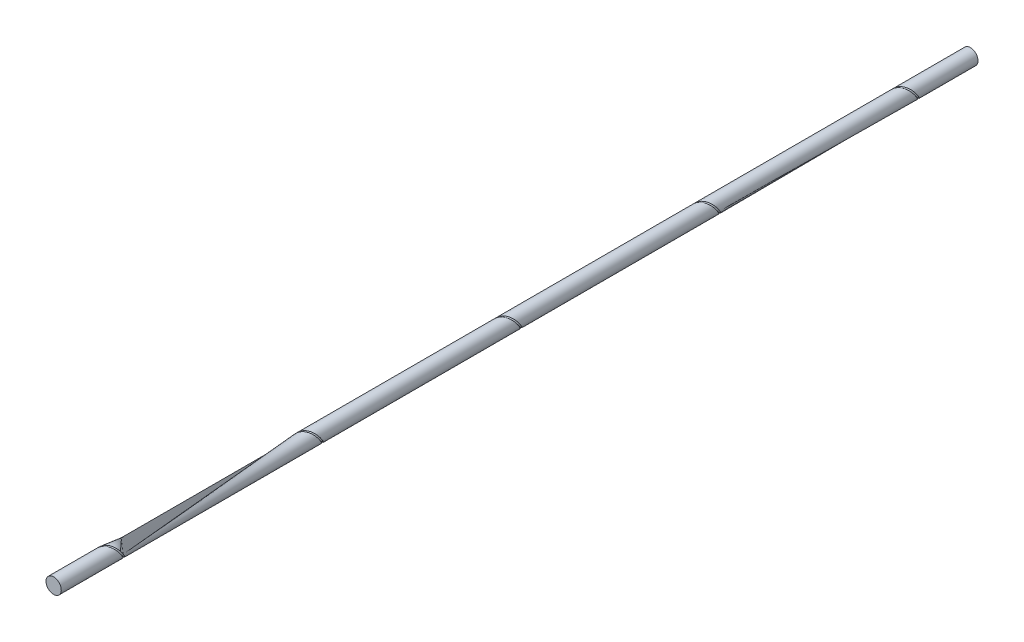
from build123d import *

# Parameters (mm, degrees)
SKETCH1_R              = 25
BOSS_EXTRUDE1_DEPTH    = 3000
CUT_SWEEP1_PITCH       = 100
CUT_SWEEP1_HEIGHT      = 100
CUT_SWEEP1_RADIUS      = 27.646
CUT_SWEEP1_START_ANGLE = -180
SKETCH3_R              = 3.969
LPATTERN1_COUNT        = 5
LPATTERN1_PITCH        = 650


with BuildPart() as part:
    # Sketch1 → Boss-Extrude1 (new body)
    with BuildSketch(Plane.XY):
        Circle(SKETCH1_R)
    extrude(amount=BOSS_EXTRUDE1_DEPTH)

    # Cut-Sweep1: sweep along a helix
    with BuildLine() as cut_sweep1_path:
        add(Helix(CUT_SWEEP1_PITCH, CUT_SWEEP1_HEIGHT, CUT_SWEEP1_RADIUS, center=(0, 0, 150), direction=(0, 0, 1), mode=Mode.PRIVATE).rotate(Axis((0, 0, 150), (0, 0, 1)), CUT_SWEEP1_START_ANGLE))
    # Sketch3 → Cut-Sweep1 (sweep, cut)
    with BuildSketch(Plane(origin=(0, 0, 0), x_dir=(1, 0, 0), z_dir=(0, 1, 0))):
        with Locations((-27.646, -150)):
            Circle(SKETCH3_R)
    cut_sweep1 = sweep(path=cut_sweep1_path.line, is_frenet=True, mode=Mode.SUBTRACT)

    # LPattern1: Cut-Sweep1 ×5
    with Locations(*[(0, 0, i * LPATTERN1_PITCH) for i in range(1, LPATTERN1_COUNT)]):
        add(cut_sweep1, mode=Mode.SUBTRACT)


solid = part.part
